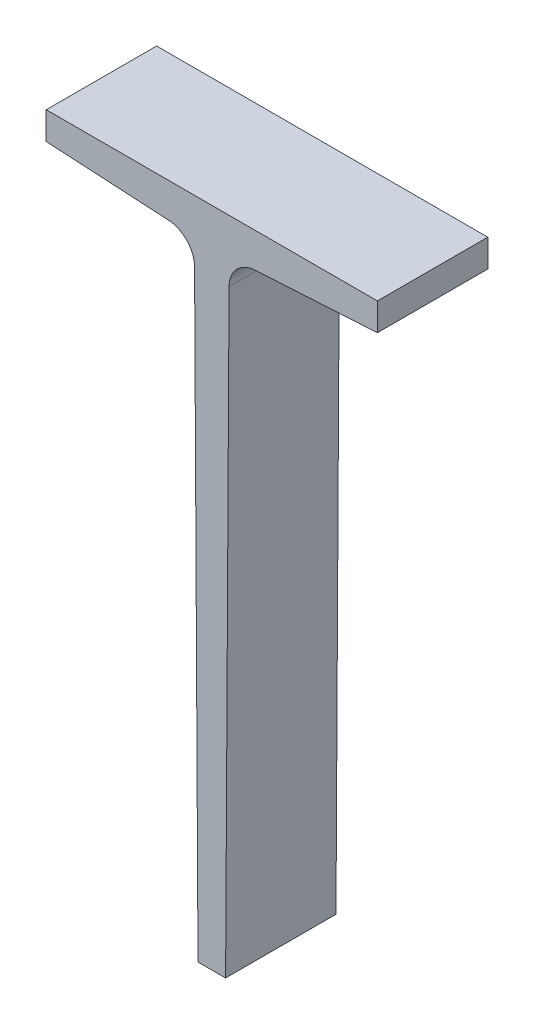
from build123d import *

# Parameters (mm, degrees)
BASE_T_DEPTH = 12.7


with BuildPart() as part:
    # Sketch1 → Base-T (new, symmetric)
    with BuildSketch(Plane.XY):
        with BuildLine():
            Line((0, 0), (76.2, 0))
            Line((76.2, 0), (76.2, -6.35))
            Line((76.2, -6.35), (48.060970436, -7.9375))
            ThreePointArc((48.060970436, -7.9375), (43.816340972, -9.902342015), (42.06875, -14.24093732))
            Line((42.06875, -14.24093732), (41.275, -152.4))
            Line((41.275, -152.4), (34.925, -152.4))
            Line((34.925, -152.4), (34.13125, -14.24093732))
            ThreePointArc((34.13125, -14.24093732), (32.383659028, -9.902342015), (28.139029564, -7.9375))
            Line((28.139029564, -7.9375), (0, -6.35))
            Line((0, -6.35), (0, 0))
        make_face()
    extrude(amount=BASE_T_DEPTH, both=True)


solid = part.part
